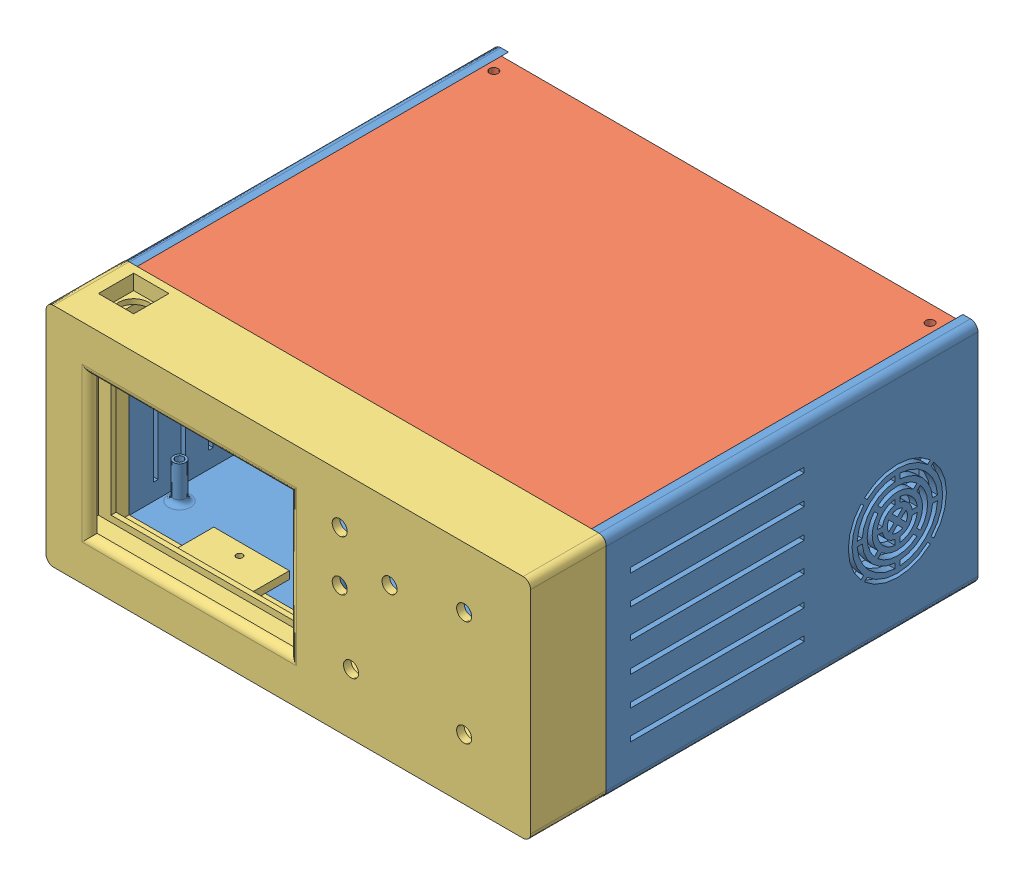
SolidWorks assembly Assem1.SLDASM, configuration Default (file format 13000). Lengths in mm.
Overall size (192.4 104.59 177.6).
3 component instances, 3 part files, 9 mates.
Components (placement in the parent):
- main-1: main.SLDPRT [Default] at (-65.012 72.1614 239.0749) size (192.4 104.4 147.6)
- top lid-1: top lid.SLDPRT [Default] at (-62.012 159.1614 241.8874) size (186.4 3 147.6)
- Front-1: Front.SLDPRT [Default] at (-65.012 69.352 269.0749) size (192.4 90 49.2)
Mates (geometry in assembly coordinates):
- Coincident14: coincident anti-aligned: line of main-1 through (-65.012 69.1614 239.0749) axis (0 1 0); line of Front-1 through (127.388 72.1614 239.0749) axis (0 1 0)
- Coincident16: coincident aligned: line of main-1 through (127.388 69.1614 239.0749) axis (0 1 0); line of Front-1 through (-65.012 156.1614 239.0749) axis (0 -1 0)
- Coincident17: coincident aligned: plane of top lid-1 through (-63.452 159.1614 239.0749) normal (0 1 0); plane of Front-1 through (-65.012 69.1614 239.0749) normal (0 -1 0)
- Coincident21: coincident aligned: line of main-1 through (127.388 72.1614 239.0749) axis (0 1 0); line of Front-1 through (127.388 72.352 239.0749) axis (0 1 0)
- Coincident22: coincident anti-aligned: line of main-1 through (-65.012 72.1614 239.0749) axis (0 1 0); line of Front-1 through (-65.012 156.352 239.0749) axis (0 -1 0)
- Coincident23: coincident aligned: line of main-1 through (-62.012 69.1614 239.0749) axis (1 0 0); line of Front-1 through (-62.012 69.1614 239.0749) axis (1 0 0)
- Coincident24: coincident anti-aligned: line of top lid-1 through (-63.452 159.1614 239.0749) axis (1 0 0); line of Front-1 through (124.388 159.1614 239.0749) axis (-1 0 0)
- Coincident25: coincident anti-aligned: line of main-1 through (124.388 156.1614 94.4749) axis (0 0 1); line of top lid-1 through (124.388 156.1614 241.8874) axis (0 0 -1)
- Coincident26: coincident aligned: line of main-1 through (-62.012 156.1614 94.4749) axis (0 0 1); line of top lid-1 through (-62.012 156.1614 94.2874) axis (0 0 1)
